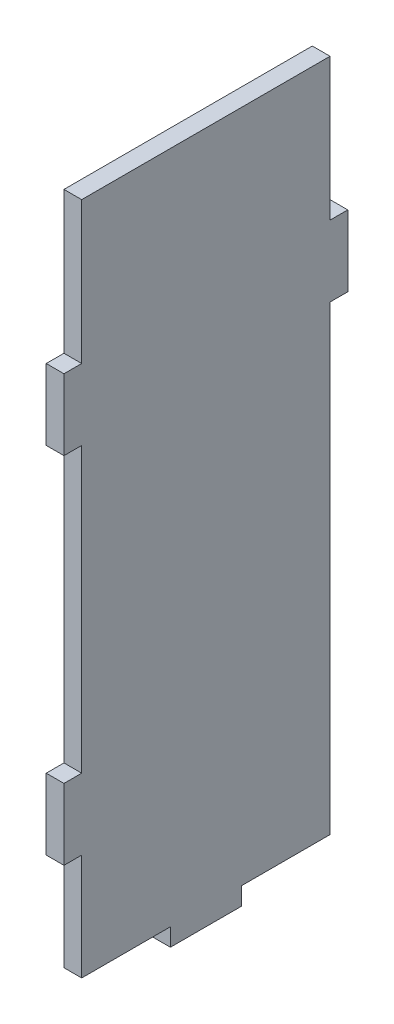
ISO-10303-21;
HEADER;
FILE_DESCRIPTION(('STEP AP214'),'2;1');
FILE_NAME('part.step','',(''),(''),'','','');
FILE_SCHEMA(('AUTOMOTIVE_DESIGN { 1 0 10303 214 1 1 1 1 }'));
ENDSEC;
DATA;
#1=APPLICATION_CONTEXT('core data for automotive mechanical design processes');
#2=APPLICATION_PROTOCOL_DEFINITION('international standard','automotive_design',2000,#1);
#3=PRODUCT_CONTEXT('',#1,'mechanical');
#4=PRODUCT('Part','Part','',(#3));
#5=PRODUCT_RELATED_PRODUCT_CATEGORY('part','',(#4));
#6=PRODUCT_DEFINITION_FORMATION('','',#4);
#7=PRODUCT_DEFINITION_CONTEXT('part definition',#1,'design');
#8=PRODUCT_DEFINITION('design','',#6,#7);
#9=PRODUCT_DEFINITION_SHAPE('','',#8);
#10=(LENGTH_UNIT() NAMED_UNIT(*) SI_UNIT(.MILLI.,.METRE.));
#11=(NAMED_UNIT(*) PLANE_ANGLE_UNIT() SI_UNIT($,.RADIAN.));
#12=(NAMED_UNIT(*) SI_UNIT($,.STERADIAN.) SOLID_ANGLE_UNIT());
#13=UNCERTAINTY_MEASURE_WITH_UNIT(LENGTH_MEASURE(1.E-05),#10,'distance_accuracy_value','');
#14=(GEOMETRIC_REPRESENTATION_CONTEXT(3) GLOBAL_UNCERTAINTY_ASSIGNED_CONTEXT((#13)) GLOBAL_UNIT_ASSIGNED_CONTEXT((#10,
#11,#12)) REPRESENTATION_CONTEXT('',''));
#15=CARTESIAN_POINT('',(0.,0.,0.));
#16=DIRECTION('',(0.,0.,1.));
#17=DIRECTION('',(1.,0.,0.));
#18=AXIS2_PLACEMENT_3D('',#15,#16,#17);
#19=CARTESIAN_POINT('',(1.5875,-63.5,-22.225));
#20=DIRECTION('',(0.,0.,1.));
#21=DIRECTION('',(1.,0.,0.));
#22=AXIS2_PLACEMENT_3D('',#19,#20,#21);
#23=PLANE('',#22);
#24=DIRECTION('',(0.,1.,0.));
#25=VECTOR('',#24,1.);
#26=CARTESIAN_POINT('',(1.5875,-63.5,-22.225));
#27=LINE('',#26,#25);
#28=CARTESIAN_POINT('',(1.5875,-57.15,-22.225));
#29=VERTEX_POINT('',#28);
#30=CARTESIAN_POINT('',(1.5875,25.4,-22.225));
#31=VERTEX_POINT('',#30);
#32=EDGE_CURVE('E57',#29,#31,#27,.T.);
#33=ORIENTED_EDGE('',*,*,#32,.F.);
#34=DIRECTION('',(1.,0.,0.));
#35=VECTOR('',#34,1.);
#36=CARTESIAN_POINT('',(-1.58755,-57.15,-22.225));
#37=LINE('',#36,#35);
#38=CARTESIAN_POINT('',(-1.5875,-57.15,-22.225));
#39=VERTEX_POINT('',#38);
#40=EDGE_CURVE('E172',#39,#29,#37,.T.);
#41=ORIENTED_EDGE('',*,*,#40,.F.);
#42=DIRECTION('',(0.,1.,0.));
#43=VECTOR('',#42,1.);
#44=CARTESIAN_POINT('',(-1.5875,-63.5,-22.225));
#45=LINE('',#44,#43);
#46=CARTESIAN_POINT('',(-1.5875,25.4,-22.225));
#47=VERTEX_POINT('',#46);
#48=EDGE_CURVE('E348',#39,#47,#45,.T.);
#49=ORIENTED_EDGE('',*,*,#48,.T.);
#50=DIRECTION('',(1.,0.,0.));
#51=VECTOR('',#50,1.);
#52=CARTESIAN_POINT('',(-14.6783603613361,25.4,-22.225));
#53=LINE('',#52,#51);
#54=EDGE_CURVE('E174',#47,#31,#53,.T.);
#55=ORIENTED_EDGE('',*,*,#54,.T.);
#56=EDGE_LOOP('',(#33,#41,#49,#55));
#57=FACE_BOUND('',#56,.T.);
#58=ADVANCED_FACE('F35',(#57),#23,.F.);
#59=DIRECTION('',(1.,0.,0.));
#60=VECTOR('',#59,1.);
#61=CARTESIAN_POINT('',(-14.6783603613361,38.1,-22.225));
#62=LINE('',#61,#60);
#63=CARTESIAN_POINT('',(-1.5875,38.1,-22.225));
#64=VERTEX_POINT('',#63);
#65=CARTESIAN_POINT('',(1.5875,38.1,-22.225));
#66=VERTEX_POINT('',#65);
#67=EDGE_CURVE('E224',#64,#66,#62,.T.);
#68=ORIENTED_EDGE('',*,*,#67,.F.);
#69=CARTESIAN_POINT('',(-1.5875,63.5,-22.225));
#70=VERTEX_POINT('',#69);
#71=EDGE_CURVE('E346',#64,#70,#45,.T.);
#72=ORIENTED_EDGE('',*,*,#71,.T.);
#73=DIRECTION('',(-1.,0.,0.));
#74=VECTOR('',#73,1.);
#75=CARTESIAN_POINT('',(1.5875,63.5,-22.225));
#76=LINE('',#75,#74);
#77=CARTESIAN_POINT('',(1.5875,63.5,-22.225));
#78=VERTEX_POINT('',#77);
#79=EDGE_CURVE('E321',#78,#70,#76,.T.);
#80=ORIENTED_EDGE('',*,*,#79,.F.);
#81=EDGE_CURVE('E177',#66,#78,#27,.T.);
#82=ORIENTED_EDGE('',*,*,#81,.F.);
#83=EDGE_LOOP('',(#68,#72,#80,#82));
#84=FACE_BOUND('',#83,.T.);
#85=ADVANCED_FACE('F429',(#84),#23,.F.);
#86=CARTESIAN_POINT('',(1.5875,-63.5,22.225));
#87=DIRECTION('',(0.,0.,-1.));
#88=DIRECTION('',(-1.,0.,0.));
#89=AXIS2_PLACEMENT_3D('',#86,#87,#88);
#90=PLANE('',#89);
#91=DIRECTION('',(0.,-1.,0.));
#92=VECTOR('',#91,1.);
#93=CARTESIAN_POINT('',(-1.5875,-63.5,22.225));
#94=LINE('',#93,#92);
#95=CARTESIAN_POINT('',(-1.5875,25.4,22.225));
#96=VERTEX_POINT('',#95);
#97=CARTESIAN_POINT('',(-1.5875,-25.4,22.225));
#98=VERTEX_POINT('',#97);
#99=EDGE_CURVE('E304',#96,#98,#94,.T.);
#100=ORIENTED_EDGE('',*,*,#99,.T.);
#101=DIRECTION('',(1.,0.,0.));
#102=VECTOR('',#101,1.);
#103=CARTESIAN_POINT('',(-14.6783603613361,-25.4,22.225));
#104=LINE('',#103,#102);
#105=CARTESIAN_POINT('',(1.5875,-25.4,22.225));
#106=VERTEX_POINT('',#105);
#107=EDGE_CURVE('E267',#98,#106,#104,.T.);
#108=ORIENTED_EDGE('',*,*,#107,.T.);
#109=DIRECTION('',(0.,-1.,0.));
#110=VECTOR('',#109,1.);
#111=CARTESIAN_POINT('',(1.5875,-63.5,22.225));
#112=LINE('',#111,#110);
#113=CARTESIAN_POINT('',(1.5875,25.4,22.225));
#114=VERTEX_POINT('',#113);
#115=EDGE_CURVE('E335',#114,#106,#112,.T.);
#116=ORIENTED_EDGE('',*,*,#115,.F.);
#117=DIRECTION('',(1.,0.,0.));
#118=VECTOR('',#117,1.);
#119=CARTESIAN_POINT('',(-14.6783603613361,25.4,22.225));
#120=LINE('',#119,#118);
#121=EDGE_CURVE('E285',#96,#114,#120,.T.);
#122=ORIENTED_EDGE('',*,*,#121,.F.);
#123=EDGE_LOOP('',(#100,#108,#116,#122));
#124=FACE_BOUND('',#123,.T.);
#125=ADVANCED_FACE('F377',(#124),#90,.F.);
#126=CARTESIAN_POINT('',(-1.5875,-38.1,22.225));
#127=VERTEX_POINT('',#126);
#128=CARTESIAN_POINT('',(-1.5875,-57.15,22.225));
#129=VERTEX_POINT('',#128);
#130=EDGE_CURVE('E300',#127,#129,#94,.T.);
#131=ORIENTED_EDGE('',*,*,#130,.T.);
#132=DIRECTION('',(1.,0.,0.));
#133=VECTOR('',#132,1.);
#134=CARTESIAN_POINT('',(-1.58755,-57.15,22.225));
#135=LINE('',#134,#133);
#136=CARTESIAN_POINT('',(1.5875,-57.15,22.225));
#137=VERTEX_POINT('',#136);
#138=EDGE_CURVE('E200',#129,#137,#135,.T.);
#139=ORIENTED_EDGE('',*,*,#138,.T.);
#140=CARTESIAN_POINT('',(1.5875,-38.1,22.225));
#141=VERTEX_POINT('',#140);
#142=EDGE_CURVE('E306',#141,#137,#112,.T.);
#143=ORIENTED_EDGE('',*,*,#142,.F.);
#144=DIRECTION('',(1.,0.,0.));
#145=VECTOR('',#144,1.);
#146=CARTESIAN_POINT('',(-14.6783603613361,-38.1,22.225));
#147=LINE('',#146,#145);
#148=EDGE_CURVE('E260',#127,#141,#147,.T.);
#149=ORIENTED_EDGE('',*,*,#148,.F.);
#150=EDGE_LOOP('',(#131,#139,#143,#149));
#151=FACE_BOUND('',#150,.T.);
#152=ADVANCED_FACE('F395',(#151),#90,.F.);
#153=CARTESIAN_POINT('',(1.5875,63.5,22.225));
#154=DIRECTION('',(0.,-1.,0.));
#155=DIRECTION('',(0.,0.,-1.));
#156=AXIS2_PLACEMENT_3D('',#153,#154,#155);
#157=PLANE('',#156);
#158=DIRECTION('',(0.,0.,1.));
#159=VECTOR('',#158,1.);
#160=CARTESIAN_POINT('',(-1.5875,63.5,22.225));
#161=LINE('',#160,#159);
#162=CARTESIAN_POINT('',(-1.5875,63.5,22.225));
#163=VERTEX_POINT('',#162);
#164=EDGE_CURVE('E305',#70,#163,#161,.T.);
#165=ORIENTED_EDGE('',*,*,#164,.T.);
#166=DIRECTION('',(-1.,0.,0.));
#167=VECTOR('',#166,1.);
#168=CARTESIAN_POINT('',(1.5875,63.5,22.225));
#169=LINE('',#168,#167);
#170=CARTESIAN_POINT('',(1.5875,63.5,22.225));
#171=VERTEX_POINT('',#170);
#172=EDGE_CURVE('E312',#171,#163,#169,.T.);
#173=ORIENTED_EDGE('',*,*,#172,.F.);
#174=DIRECTION('',(0.,0.,1.));
#175=VECTOR('',#174,1.);
#176=CARTESIAN_POINT('',(1.5875,63.5,22.225));
#177=LINE('',#176,#175);
#178=EDGE_CURVE('E176',#78,#171,#177,.T.);
#179=ORIENTED_EDGE('',*,*,#178,.F.);
#180=ORIENTED_EDGE('',*,*,#79,.T.);
#181=EDGE_LOOP('',(#165,#173,#179,#180));
#182=FACE_BOUND('',#181,.T.);
#183=ADVANCED_FACE('F398',(#182),#157,.F.);
#184=CARTESIAN_POINT('',(-1.5875,38.1,22.225));
#185=VERTEX_POINT('',#184);
#186=EDGE_CURVE('E319',#163,#185,#94,.T.);
#187=ORIENTED_EDGE('',*,*,#186,.T.);
#188=DIRECTION('',(1.,0.,0.));
#189=VECTOR('',#188,1.);
#190=CARTESIAN_POINT('',(-14.6783603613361,38.1,22.225));
#191=LINE('',#190,#189);
#192=CARTESIAN_POINT('',(1.5875,38.1,22.225));
#193=VERTEX_POINT('',#192);
#194=EDGE_CURVE('E288',#185,#193,#191,.T.);
#195=ORIENTED_EDGE('',*,*,#194,.T.);
#196=EDGE_CURVE('E329',#171,#193,#112,.T.);
#197=ORIENTED_EDGE('',*,*,#196,.F.);
#198=ORIENTED_EDGE('',*,*,#172,.T.);
#199=EDGE_LOOP('',(#187,#195,#197,#198));
#200=FACE_BOUND('',#199,.T.);
#201=ADVANCED_FACE('F400',(#200),#90,.F.);
#202=CARTESIAN_POINT('',(1.5875,0.,0.));
#203=DIRECTION('',(-1.,0.,0.));
#204=DIRECTION('',(0.,0.,1.));
#205=AXIS2_PLACEMENT_3D('',#202,#203,#204);
#206=PLANE('',#205);
#207=DIRECTION('',(0.,0.,1.));
#208=VECTOR('',#207,1.);
#209=CARTESIAN_POINT('',(1.5875,-57.15,-22.225));
#210=LINE('',#209,#208);
#211=CARTESIAN_POINT('',(1.5875,-57.15,-6.35));
#212=VERTEX_POINT('',#211);
#213=EDGE_CURVE('E180',#29,#212,#210,.T.);
#214=ORIENTED_EDGE('',*,*,#213,.F.);
#215=ORIENTED_EDGE('',*,*,#32,.T.);
#216=DIRECTION('',(0.,0.,1.));
#217=VECTOR('',#216,1.);
#218=CARTESIAN_POINT('',(1.5875,25.4,-22.225));
#219=LINE('',#218,#217);
#220=CARTESIAN_POINT('',(1.5875,25.4,-25.4));
#221=VERTEX_POINT('',#220);
#222=EDGE_CURVE('E413',#221,#31,#219,.T.);
#223=ORIENTED_EDGE('',*,*,#222,.F.);
#224=DIRECTION('',(0.,-1.,0.));
#225=VECTOR('',#224,1.);
#226=CARTESIAN_POINT('',(1.5875,38.1,-25.4));
#227=LINE('',#226,#225);
#228=CARTESIAN_POINT('',(1.5875,38.1,-25.4));
#229=VERTEX_POINT('',#228);
#230=EDGE_CURVE('E210',#229,#221,#227,.T.);
#231=ORIENTED_EDGE('',*,*,#230,.F.);
#232=DIRECTION('',(0.,0.,-1.));
#233=VECTOR('',#232,1.);
#234=CARTESIAN_POINT('',(1.5875,38.1,-22.225));
#235=LINE('',#234,#233);
#236=EDGE_CURVE('E228',#66,#229,#235,.T.);
#237=ORIENTED_EDGE('',*,*,#236,.F.);
#238=ORIENTED_EDGE('',*,*,#81,.T.);
#239=ORIENTED_EDGE('',*,*,#178,.T.);
#240=ORIENTED_EDGE('',*,*,#196,.T.);
#241=DIRECTION('',(0.,0.,1.));
#242=VECTOR('',#241,1.);
#243=CARTESIAN_POINT('',(1.5875,38.1,22.225));
#244=LINE('',#243,#242);
#245=CARTESIAN_POINT('',(1.5875,38.1,25.4));
#246=VERTEX_POINT('',#245);
#247=EDGE_CURVE('E271',#193,#246,#244,.T.);
#248=ORIENTED_EDGE('',*,*,#247,.T.);
#249=DIRECTION('',(0.,-1.,0.));
#250=VECTOR('',#249,1.);
#251=CARTESIAN_POINT('',(1.5875,38.1,25.4));
#252=LINE('',#251,#250);
#253=CARTESIAN_POINT('',(1.5875,25.4,25.4));
#254=VERTEX_POINT('',#253);
#255=EDGE_CURVE('E272',#246,#254,#252,.T.);
#256=ORIENTED_EDGE('',*,*,#255,.T.);
#257=DIRECTION('',(0.,0.,-1.));
#258=VECTOR('',#257,1.);
#259=CARTESIAN_POINT('',(1.5875,25.4,22.225));
#260=LINE('',#259,#258);
#261=EDGE_CURVE('E275',#254,#114,#260,.T.);
#262=ORIENTED_EDGE('',*,*,#261,.T.);
#263=ORIENTED_EDGE('',*,*,#115,.T.);
#264=DIRECTION('',(0.,0.,1.));
#265=VECTOR('',#264,1.);
#266=CARTESIAN_POINT('',(1.5875,-25.4,22.225));
#267=LINE('',#266,#265);
#268=CARTESIAN_POINT('',(1.5875,-25.4,25.4));
#269=VERTEX_POINT('',#268);
#270=EDGE_CURVE('E218',#106,#269,#267,.T.);
#271=ORIENTED_EDGE('',*,*,#270,.T.);
#272=DIRECTION('',(0.,-1.,0.));
#273=VECTOR('',#272,1.);
#274=CARTESIAN_POINT('',(1.5875,-25.4,25.4));
#275=LINE('',#274,#273);
#276=CARTESIAN_POINT('',(1.5875,-38.1,25.4));
#277=VERTEX_POINT('',#276);
#278=EDGE_CURVE('E249',#269,#277,#275,.T.);
#279=ORIENTED_EDGE('',*,*,#278,.T.);
#280=DIRECTION('',(0.,0.,-1.));
#281=VECTOR('',#280,1.);
#282=CARTESIAN_POINT('',(1.5875,-38.1,22.225));
#283=LINE('',#282,#281);
#284=EDGE_CURVE('E245',#277,#141,#283,.T.);
#285=ORIENTED_EDGE('',*,*,#284,.T.);
#286=ORIENTED_EDGE('',*,*,#142,.T.);
#287=DIRECTION('',(0.,0.,1.));
#288=VECTOR('',#287,1.);
#289=CARTESIAN_POINT('',(1.5875,-57.15,22.225));
#290=LINE('',#289,#288);
#291=CARTESIAN_POINT('',(1.5875,-57.15,6.35));
#292=VERTEX_POINT('',#291);
#293=EDGE_CURVE('E184',#292,#137,#290,.T.);
#294=ORIENTED_EDGE('',*,*,#293,.F.);
#295=DIRECTION('',(0.,1.,0.));
#296=VECTOR('',#295,1.);
#297=CARTESIAN_POINT('',(1.5875,-60.325,6.35));
#298=LINE('',#297,#296);
#299=CARTESIAN_POINT('',(1.5875,-60.325,6.35));
#300=VERTEX_POINT('',#299);
#301=EDGE_CURVE('E196',#300,#292,#298,.T.);
#302=ORIENTED_EDGE('',*,*,#301,.F.);
#303=DIRECTION('',(0.,0.,1.));
#304=VECTOR('',#303,1.);
#305=CARTESIAN_POINT('',(1.5875,-60.325,6.35));
#306=LINE('',#305,#304);
#307=CARTESIAN_POINT('',(1.5875,-60.325,-6.35));
#308=VERTEX_POINT('',#307);
#309=EDGE_CURVE('E191',#308,#300,#306,.T.);
#310=ORIENTED_EDGE('',*,*,#309,.F.);
#311=DIRECTION('',(0.,-1.,0.));
#312=VECTOR('',#311,1.);
#313=CARTESIAN_POINT('',(1.5875,-60.325,-6.35));
#314=LINE('',#313,#312);
#315=EDGE_CURVE('E189',#212,#308,#314,.T.);
#316=ORIENTED_EDGE('',*,*,#315,.F.);
#317=EDGE_LOOP('',(#214,#215,#223,#231,#237,#238,#239,#240,#248,#256,#262,#263,#271,#279,#285,
#286,#294,#302,#310,#316));
#318=FACE_BOUND('',#317,.T.);
#319=ADVANCED_FACE('F186',(#318),#206,.F.);
#320=CARTESIAN_POINT('',(-1.5875,0.,0.));
#321=DIRECTION('',(-1.,0.,0.));
#322=DIRECTION('',(0.,0.,1.));
#323=AXIS2_PLACEMENT_3D('',#320,#321,#322);
#324=PLANE('',#323);
#325=ORIENTED_EDGE('',*,*,#48,.F.);
#326=DIRECTION('',(0.,0.,-1.));
#327=VECTOR('',#326,1.);
#328=CARTESIAN_POINT('',(-1.5875,-57.15,0.));
#329=LINE('',#328,#327);
#330=CARTESIAN_POINT('',(-1.5875,-57.15,-6.35));
#331=VERTEX_POINT('',#330);
#332=EDGE_CURVE('E183',#331,#39,#329,.T.);
#333=ORIENTED_EDGE('',*,*,#332,.F.);
#334=DIRECTION('',(0.,1.,0.));
#335=VECTOR('',#334,1.);
#336=CARTESIAN_POINT('',(-1.5875,0.,-6.35));
#337=LINE('',#336,#335);
#338=CARTESIAN_POINT('',(-1.5875,-60.325,-6.35));
#339=VERTEX_POINT('',#338);
#340=EDGE_CURVE('E326',#339,#331,#337,.T.);
#341=ORIENTED_EDGE('',*,*,#340,.F.);
#342=DIRECTION('',(0.,0.,-1.));
#343=VECTOR('',#342,1.);
#344=CARTESIAN_POINT('',(-1.5875,-60.325,0.));
#345=LINE('',#344,#343);
#346=CARTESIAN_POINT('',(-1.5875,-60.325,6.35));
#347=VERTEX_POINT('',#346);
#348=EDGE_CURVE('E621',#347,#339,#345,.T.);
#349=ORIENTED_EDGE('',*,*,#348,.F.);
#350=DIRECTION('',(0.,-1.,0.));
#351=VECTOR('',#350,1.);
#352=CARTESIAN_POINT('',(-1.5875,0.,6.35));
#353=LINE('',#352,#351);
#354=CARTESIAN_POINT('',(-1.5875,-57.15,6.35));
#355=VERTEX_POINT('',#354);
#356=EDGE_CURVE('E42',#355,#347,#353,.T.);
#357=ORIENTED_EDGE('',*,*,#356,.F.);
#358=DIRECTION('',(0.,0.,-1.));
#359=VECTOR('',#358,1.);
#360=CARTESIAN_POINT('',(-1.5875,-57.15,0.));
#361=LINE('',#360,#359);
#362=EDGE_CURVE('E11',#129,#355,#361,.T.);
#363=ORIENTED_EDGE('',*,*,#362,.F.);
#364=ORIENTED_EDGE('',*,*,#130,.F.);
#365=DIRECTION('',(0.,0.,-1.));
#366=VECTOR('',#365,1.);
#367=CARTESIAN_POINT('',(-1.5875,-38.1,22.225));
#368=LINE('',#367,#366);
#369=CARTESIAN_POINT('',(-1.5875,-38.1,25.4));
#370=VERTEX_POINT('',#369);
#371=EDGE_CURVE('E257',#370,#127,#368,.T.);
#372=ORIENTED_EDGE('',*,*,#371,.F.);
#373=DIRECTION('',(0.,-1.,0.));
#374=VECTOR('',#373,1.);
#375=CARTESIAN_POINT('',(-1.5875,-25.4,25.4));
#376=LINE('',#375,#374);
#377=CARTESIAN_POINT('',(-1.5875,-25.4,25.4));
#378=VERTEX_POINT('',#377);
#379=EDGE_CURVE('E262',#378,#370,#376,.T.);
#380=ORIENTED_EDGE('',*,*,#379,.F.);
#381=DIRECTION('',(0.,0.,1.));
#382=VECTOR('',#381,1.);
#383=CARTESIAN_POINT('',(-1.5875,-25.4,22.225));
#384=LINE('',#383,#382);
#385=EDGE_CURVE('E248',#98,#378,#384,.T.);
#386=ORIENTED_EDGE('',*,*,#385,.F.);
#387=ORIENTED_EDGE('',*,*,#99,.F.);
#388=DIRECTION('',(0.,0.,-1.));
#389=VECTOR('',#388,1.);
#390=CARTESIAN_POINT('',(-1.5875,25.4,22.225));
#391=LINE('',#390,#389);
#392=CARTESIAN_POINT('',(-1.5875,25.4,25.4));
#393=VERTEX_POINT('',#392);
#394=EDGE_CURVE('E289',#393,#96,#391,.T.);
#395=ORIENTED_EDGE('',*,*,#394,.F.);
#396=DIRECTION('',(0.,-1.,0.));
#397=VECTOR('',#396,1.);
#398=CARTESIAN_POINT('',(-1.5875,38.1,25.4));
#399=LINE('',#398,#397);
#400=CARTESIAN_POINT('',(-1.5875,38.1,25.4));
#401=VERTEX_POINT('',#400);
#402=EDGE_CURVE('E276',#401,#393,#399,.T.);
#403=ORIENTED_EDGE('',*,*,#402,.F.);
#404=DIRECTION('',(0.,0.,1.));
#405=VECTOR('',#404,1.);
#406=CARTESIAN_POINT('',(-1.5875,38.1,22.225));
#407=LINE('',#406,#405);
#408=EDGE_CURVE('E297',#185,#401,#407,.T.);
#409=ORIENTED_EDGE('',*,*,#408,.F.);
#410=ORIENTED_EDGE('',*,*,#186,.F.);
#411=ORIENTED_EDGE('',*,*,#164,.F.);
#412=ORIENTED_EDGE('',*,*,#71,.F.);
#413=DIRECTION('',(0.,0.,-1.));
#414=VECTOR('',#413,1.);
#415=CARTESIAN_POINT('',(-1.5875,38.1,-22.225));
#416=LINE('',#415,#414);
#417=CARTESIAN_POINT('',(-1.5875,38.1,-25.4));
#418=VERTEX_POINT('',#417);
#419=EDGE_CURVE('E219',#64,#418,#416,.T.);
#420=ORIENTED_EDGE('',*,*,#419,.T.);
#421=DIRECTION('',(0.,-1.,0.));
#422=VECTOR('',#421,1.);
#423=CARTESIAN_POINT('',(-1.5875,38.1,-25.4));
#424=LINE('',#423,#422);
#425=CARTESIAN_POINT('',(-1.5875,25.4,-25.4));
#426=VERTEX_POINT('',#425);
#427=EDGE_CURVE('E215',#418,#426,#424,.T.);
#428=ORIENTED_EDGE('',*,*,#427,.T.);
#429=DIRECTION('',(0.,0.,1.));
#430=VECTOR('',#429,1.);
#431=CARTESIAN_POINT('',(-1.5875,25.4,-22.225));
#432=LINE('',#431,#430);
#433=EDGE_CURVE('E237',#426,#47,#432,.T.);
#434=ORIENTED_EDGE('',*,*,#433,.T.);
#435=EDGE_LOOP('',(#325,#333,#341,#349,#357,#363,#364,#372,#380,#386,#387,#395,#403,#409,#410,
#411,#412,#420,#428,#434));
#436=FACE_BOUND('',#435,.T.);
#437=ADVANCED_FACE('F380',(#436),#324,.T.);
#438=CARTESIAN_POINT('',(-14.6783603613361,38.1,22.225));
#439=DIRECTION('',(0.,1.,0.));
#440=DIRECTION('',(0.,0.,1.));
#441=AXIS2_PLACEMENT_3D('',#438,#439,#440);
#442=PLANE('',#441);
#443=ORIENTED_EDGE('',*,*,#194,.F.);
#444=ORIENTED_EDGE('',*,*,#408,.T.);
#445=DIRECTION('',(1.,0.,0.));
#446=VECTOR('',#445,1.);
#447=CARTESIAN_POINT('',(-14.6783603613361,38.1,25.4));
#448=LINE('',#447,#446);
#449=EDGE_CURVE('E280',#401,#246,#448,.T.);
#450=ORIENTED_EDGE('',*,*,#449,.T.);
#451=ORIENTED_EDGE('',*,*,#247,.F.);
#452=EDGE_LOOP('',(#443,#444,#450,#451));
#453=FACE_BOUND('',#452,.T.);
#454=ADVANCED_FACE('F366',(#453),#442,.T.);
#455=CARTESIAN_POINT('',(-14.6783603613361,38.1,25.4));
#456=DIRECTION('',(0.,0.,1.));
#457=DIRECTION('',(1.,0.,0.));
#458=AXIS2_PLACEMENT_3D('',#455,#456,#457);
#459=PLANE('',#458);
#460=ORIENTED_EDGE('',*,*,#449,.F.);
#461=ORIENTED_EDGE('',*,*,#402,.T.);
#462=DIRECTION('',(1.,0.,0.));
#463=VECTOR('',#462,1.);
#464=CARTESIAN_POINT('',(-14.6783603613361,25.4,25.4));
#465=LINE('',#464,#463);
#466=EDGE_CURVE('E279',#393,#254,#465,.T.);
#467=ORIENTED_EDGE('',*,*,#466,.T.);
#468=ORIENTED_EDGE('',*,*,#255,.F.);
#469=EDGE_LOOP('',(#460,#461,#467,#468));
#470=FACE_BOUND('',#469,.T.);
#471=ADVANCED_FACE('F368',(#470),#459,.T.);
#472=CARTESIAN_POINT('',(-14.6783603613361,25.4,22.225));
#473=DIRECTION('',(0.,-1.,0.));
#474=DIRECTION('',(0.,0.,-1.));
#475=AXIS2_PLACEMENT_3D('',#472,#473,#474);
#476=PLANE('',#475);
#477=ORIENTED_EDGE('',*,*,#466,.F.);
#478=ORIENTED_EDGE('',*,*,#394,.T.);
#479=ORIENTED_EDGE('',*,*,#121,.T.);
#480=ORIENTED_EDGE('',*,*,#261,.F.);
#481=EDGE_LOOP('',(#477,#478,#479,#480));
#482=FACE_BOUND('',#481,.T.);
#483=ADVANCED_FACE('F373',(#482),#476,.T.);
#484=CARTESIAN_POINT('',(-14.6783603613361,-25.4,22.225));
#485=DIRECTION('',(0.,1.,0.));
#486=DIRECTION('',(0.,0.,1.));
#487=AXIS2_PLACEMENT_3D('',#484,#485,#486);
#488=PLANE('',#487);
#489=ORIENTED_EDGE('',*,*,#107,.F.);
#490=ORIENTED_EDGE('',*,*,#385,.T.);
#491=DIRECTION('',(1.,0.,0.));
#492=VECTOR('',#491,1.);
#493=CARTESIAN_POINT('',(-14.6783603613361,-25.4,25.4));
#494=LINE('',#493,#492);
#495=EDGE_CURVE('E256',#378,#269,#494,.T.);
#496=ORIENTED_EDGE('',*,*,#495,.T.);
#497=ORIENTED_EDGE('',*,*,#270,.F.);
#498=EDGE_LOOP('',(#489,#490,#496,#497));
#499=FACE_BOUND('',#498,.T.);
#500=ADVANCED_FACE('F385',(#499),#488,.T.);
#501=CARTESIAN_POINT('',(-14.6783603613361,-25.4,25.4));
#502=DIRECTION('',(0.,0.,1.));
#503=DIRECTION('',(1.,0.,0.));
#504=AXIS2_PLACEMENT_3D('',#501,#502,#503);
#505=PLANE('',#504);
#506=ORIENTED_EDGE('',*,*,#495,.F.);
#507=ORIENTED_EDGE('',*,*,#379,.T.);
#508=DIRECTION('',(1.,0.,0.));
#509=VECTOR('',#508,1.);
#510=CARTESIAN_POINT('',(-14.6783603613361,-38.1,25.4));
#511=LINE('',#510,#509);
#512=EDGE_CURVE('E261',#370,#277,#511,.T.);
#513=ORIENTED_EDGE('',*,*,#512,.T.);
#514=ORIENTED_EDGE('',*,*,#278,.F.);
#515=EDGE_LOOP('',(#506,#507,#513,#514));
#516=FACE_BOUND('',#515,.T.);
#517=ADVANCED_FACE('F547',(#516),#505,.T.);
#518=CARTESIAN_POINT('',(-14.6783603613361,-38.1,22.225));
#519=DIRECTION('',(0.,-1.,0.));
#520=DIRECTION('',(0.,0.,-1.));
#521=AXIS2_PLACEMENT_3D('',#518,#519,#520);
#522=PLANE('',#521);
#523=ORIENTED_EDGE('',*,*,#512,.F.);
#524=ORIENTED_EDGE('',*,*,#371,.T.);
#525=ORIENTED_EDGE('',*,*,#148,.T.);
#526=ORIENTED_EDGE('',*,*,#284,.F.);
#527=EDGE_LOOP('',(#523,#524,#525,#526));
#528=FACE_BOUND('',#527,.T.);
#529=ADVANCED_FACE('F392',(#528),#522,.T.);
#530=CARTESIAN_POINT('',(-14.6783603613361,38.1,-22.225));
#531=DIRECTION('',(0.,-1.,0.));
#532=DIRECTION('',(0.,0.,-1.));
#533=AXIS2_PLACEMENT_3D('',#530,#531,#532);
#534=PLANE('',#533);
#535=ORIENTED_EDGE('',*,*,#419,.F.);
#536=ORIENTED_EDGE('',*,*,#67,.T.);
#537=ORIENTED_EDGE('',*,*,#236,.T.);
#538=DIRECTION('',(1.,0.,0.));
#539=VECTOR('',#538,1.);
#540=CARTESIAN_POINT('',(-14.6783603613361,38.1,-25.4));
#541=LINE('',#540,#539);
#542=EDGE_CURVE('E214',#418,#229,#541,.T.);
#543=ORIENTED_EDGE('',*,*,#542,.F.);
#544=EDGE_LOOP('',(#535,#536,#537,#543));
#545=FACE_BOUND('',#544,.T.);
#546=ADVANCED_FACE('F406',(#545),#534,.F.);
#547=CARTESIAN_POINT('',(-14.6783603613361,38.1,-25.4));
#548=DIRECTION('',(0.,0.,1.));
#549=DIRECTION('',(1.,0.,0.));
#550=AXIS2_PLACEMENT_3D('',#547,#548,#549);
#551=PLANE('',#550);
#552=ORIENTED_EDGE('',*,*,#427,.F.);
#553=ORIENTED_EDGE('',*,*,#542,.T.);
#554=ORIENTED_EDGE('',*,*,#230,.T.);
#555=DIRECTION('',(1.,0.,0.));
#556=VECTOR('',#555,1.);
#557=CARTESIAN_POINT('',(-14.6783603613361,25.4,-25.4));
#558=LINE('',#557,#556);
#559=EDGE_CURVE('E213',#426,#221,#558,.T.);
#560=ORIENTED_EDGE('',*,*,#559,.F.);
#561=EDGE_LOOP('',(#552,#553,#554,#560));
#562=FACE_BOUND('',#561,.T.);
#563=ADVANCED_FACE('F409',(#562),#551,.F.);
#564=CARTESIAN_POINT('',(-14.6783603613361,25.4,-22.225));
#565=DIRECTION('',(0.,1.,0.));
#566=DIRECTION('',(0.,0.,1.));
#567=AXIS2_PLACEMENT_3D('',#564,#565,#566);
#568=PLANE('',#567);
#569=ORIENTED_EDGE('',*,*,#433,.F.);
#570=ORIENTED_EDGE('',*,*,#559,.T.);
#571=ORIENTED_EDGE('',*,*,#222,.T.);
#572=ORIENTED_EDGE('',*,*,#54,.F.);
#573=EDGE_LOOP('',(#569,#570,#571,#572));
#574=FACE_BOUND('',#573,.T.);
#575=ADVANCED_FACE('F415',(#574),#568,.F.);
#576=CARTESIAN_POINT('',(-1.58755,-57.15,22.225));
#577=DIRECTION('',(0.,1.,0.));
#578=DIRECTION('',(0.,0.,1.));
#579=AXIS2_PLACEMENT_3D('',#576,#577,#578);
#580=PLANE('',#579);
#581=ORIENTED_EDGE('',*,*,#362,.T.);
#582=DIRECTION('',(1.,0.,0.));
#583=VECTOR('',#582,1.);
#584=CARTESIAN_POINT('',(-1.58755,-57.15,6.35));
#585=LINE('',#584,#583);
#586=EDGE_CURVE('E203',#355,#292,#585,.T.);
#587=ORIENTED_EDGE('',*,*,#586,.T.);
#588=ORIENTED_EDGE('',*,*,#293,.T.);
#589=ORIENTED_EDGE('',*,*,#138,.F.);
#590=EDGE_LOOP('',(#581,#587,#588,#589));
#591=FACE_BOUND('',#590,.T.);
#592=ADVANCED_FACE('F417',(#591),#580,.F.);
#593=CARTESIAN_POINT('',(-1.58755,-60.325,6.35));
#594=DIRECTION('',(0.,0.,-1.));
#595=DIRECTION('',(-1.,0.,0.));
#596=AXIS2_PLACEMENT_3D('',#593,#594,#595);
#597=PLANE('',#596);
#598=ORIENTED_EDGE('',*,*,#356,.T.);
#599=DIRECTION('',(1.,0.,0.));
#600=VECTOR('',#599,1.);
#601=CARTESIAN_POINT('',(-1.58755,-60.325,6.35));
#602=LINE('',#601,#600);
#603=EDGE_CURVE('E205',#347,#300,#602,.T.);
#604=ORIENTED_EDGE('',*,*,#603,.T.);
#605=ORIENTED_EDGE('',*,*,#301,.T.);
#606=ORIENTED_EDGE('',*,*,#586,.F.);
#607=EDGE_LOOP('',(#598,#604,#605,#606));
#608=FACE_BOUND('',#607,.T.);
#609=ADVANCED_FACE('F423',(#608),#597,.F.);
#610=CARTESIAN_POINT('',(-1.58755,-60.325,6.35));
#611=DIRECTION('',(0.,1.,0.));
#612=DIRECTION('',(0.,0.,1.));
#613=AXIS2_PLACEMENT_3D('',#610,#611,#612);
#614=PLANE('',#613);
#615=ORIENTED_EDGE('',*,*,#348,.T.);
#616=DIRECTION('',(1.,0.,0.));
#617=VECTOR('',#616,1.);
#618=CARTESIAN_POINT('',(-1.58755,-60.325,-6.35));
#619=LINE('',#618,#617);
#620=EDGE_CURVE('E207',#339,#308,#619,.T.);
#621=ORIENTED_EDGE('',*,*,#620,.T.);
#622=ORIENTED_EDGE('',*,*,#309,.T.);
#623=ORIENTED_EDGE('',*,*,#603,.F.);
#624=EDGE_LOOP('',(#615,#621,#622,#623));
#625=FACE_BOUND('',#624,.T.);
#626=ADVANCED_FACE('F473',(#625),#614,.F.);
#627=CARTESIAN_POINT('',(-1.58755,-60.325,-6.35));
#628=DIRECTION('',(0.,0.,1.));
#629=DIRECTION('',(1.,0.,0.));
#630=AXIS2_PLACEMENT_3D('',#627,#628,#629);
#631=PLANE('',#630);
#632=ORIENTED_EDGE('',*,*,#340,.T.);
#633=DIRECTION('',(1.,0.,0.));
#634=VECTOR('',#633,1.);
#635=CARTESIAN_POINT('',(-1.58755,-57.15,-6.35));
#636=LINE('',#635,#634);
#637=EDGE_CURVE('E49',#331,#212,#636,.T.);
#638=ORIENTED_EDGE('',*,*,#637,.T.);
#639=ORIENTED_EDGE('',*,*,#315,.T.);
#640=ORIENTED_EDGE('',*,*,#620,.F.);
#641=EDGE_LOOP('',(#632,#638,#639,#640));
#642=FACE_BOUND('',#641,.T.);
#643=ADVANCED_FACE('F483',(#642),#631,.F.);
#644=CARTESIAN_POINT('',(-1.58755,-57.15,-22.225));
#645=DIRECTION('',(0.,1.,0.));
#646=DIRECTION('',(0.,0.,1.));
#647=AXIS2_PLACEMENT_3D('',#644,#645,#646);
#648=PLANE('',#647);
#649=ORIENTED_EDGE('',*,*,#332,.T.);
#650=ORIENTED_EDGE('',*,*,#40,.T.);
#651=ORIENTED_EDGE('',*,*,#213,.T.);
#652=ORIENTED_EDGE('',*,*,#637,.F.);
#653=EDGE_LOOP('',(#649,#650,#651,#652));
#654=FACE_BOUND('',#653,.T.);
#655=ADVANCED_FACE('F179',(#654),#648,.F.);
#656=CLOSED_SHELL('',(#58,#85,#125,#152,#183,#201,#319,#437,#454,#471,#483,#500,#517,#529,#546,
#563,#575,#592,#609,#626,#643,#655));
#657=MANIFOLD_SOLID_BREP('B2',#656);
#658=ADVANCED_BREP_SHAPE_REPRESENTATION('',(#18,#657),#14);
#659=SHAPE_DEFINITION_REPRESENTATION(#9,#658);
ENDSEC;
END-ISO-10303-21;
